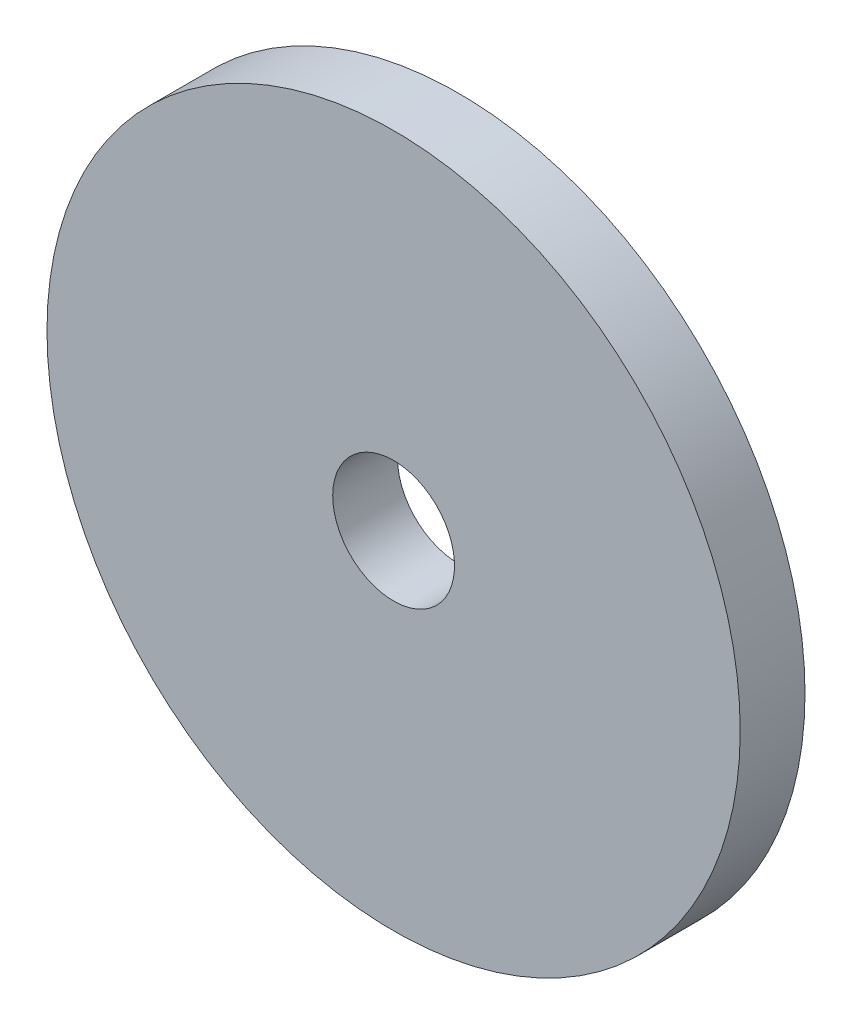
from build123d import *

# Parameters (mm, degrees)
SKETCH1_R      = 13.589
SKETCH1_R_2    = 2.3876
EXTRUDE1_DEPTH = 2.54


with BuildPart() as part:
    # Sketch1 → Extrude1 (new body)
    with BuildSketch(Plane.XY):
        with Locations(Location((0, 0, 0), (0, 0, 180))):
            Circle(SKETCH1_R)
        with Locations(Location((0, 0, 0), (0, 0, 180))):
            Circle(SKETCH1_R_2, mode=Mode.SUBTRACT)
    extrude(amount=EXTRUDE1_DEPTH)


solid = part.part
